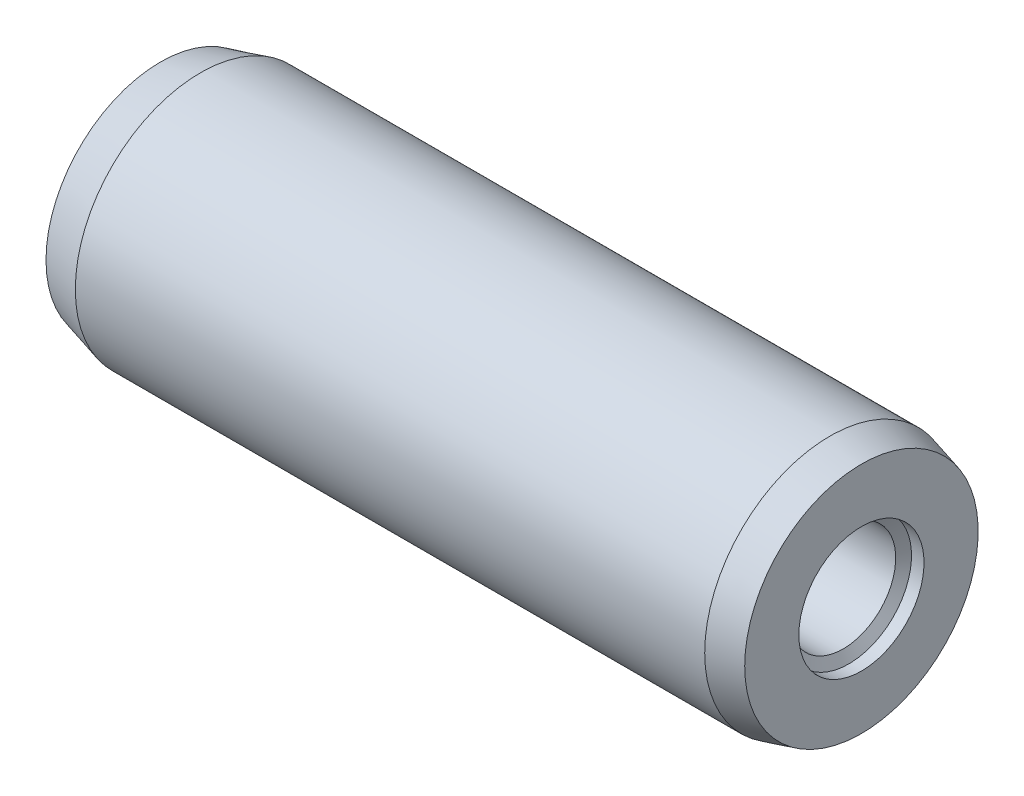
from build123d import *


with BuildPart() as part:
    # Sketch1 → Base-Revolve (revolve)
    with BuildSketch(Plane.XY, mode=Mode.PRIVATE) as base_revolve_sk:
        Polygon((0, 0), (0, 22.856406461), (8, 25), (133.7, 25), (140, 23.311920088), (140, 12.5), (137.5, 12.5), (136.345299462, 10.5), (90, 10.5), (83.6909635, 0), align=None)
    revolve(base_revolve_sk.sketch.rotate(Axis((-10, 0, 0), (1, 0, 0)), 90), axis=Axis((-10, 0, 0), (1, 0, 0)))


solid = part.part
